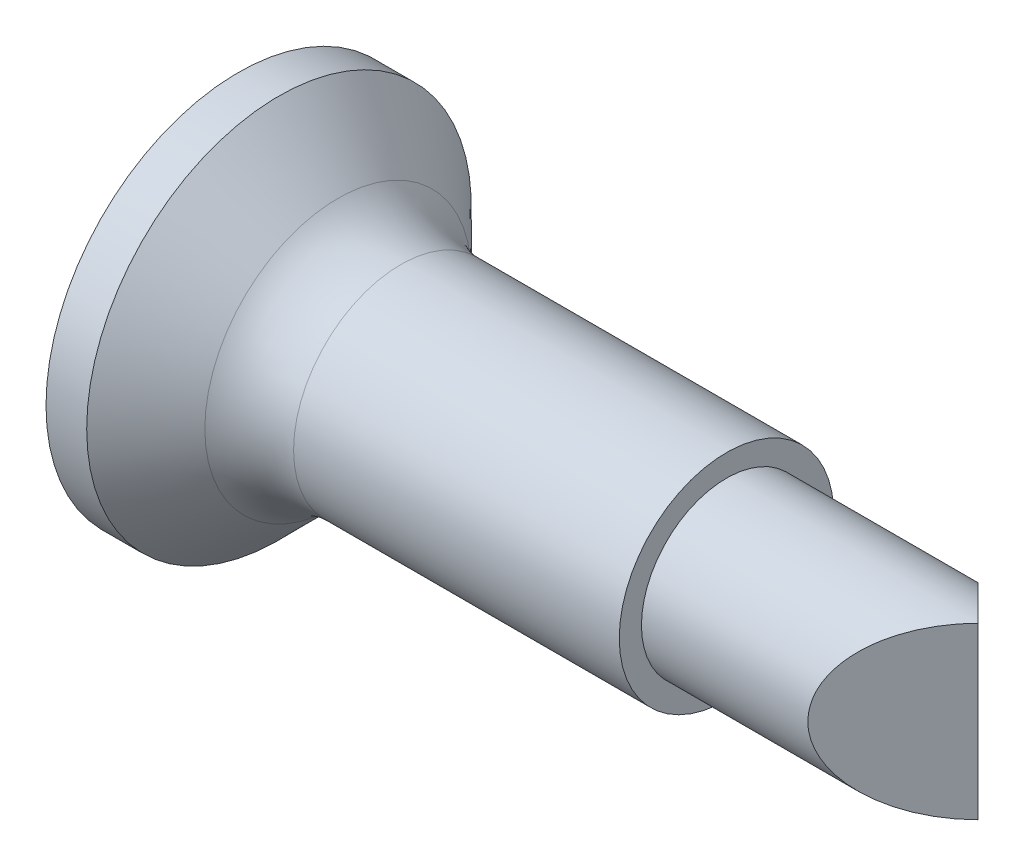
from build123d import *

# Parameters (mm, degrees)
FILLET1_R               = 1.2
CUT_EXTRUDE1_DEPTH      = 11.65457653
CUT_EXTRUDE1_DEPTH_BACK = 11.65457653
CROSSRECESS_DEPTH       = 0.566666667
FILLET2_R               = 0.32
DRAFT1_ANGLE            = 25


with BuildPart() as part:
    # Sketch1 → Base (revolve)
    with BuildSketch(Plane.XY, mode=Mode.PRIVATE) as base_sk:
        Polygon((0, 0), (0, 2.6), (0.55, 2.6), (1.7, 1.45), (6.6, 1.45), (6.6, 1.15), (10, 1.15), (10, 0), align=None)
    revolve(base_sk.sketch.rotate(Axis((-9.542985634, 0, 0), (1, 0, 0)), 90), axis=Axis((-9.542985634, 0, 0), (1, 0, 0)))

    # Fillet1
    fillet1_edges = [part.edges().sort_by_distance(p)[0] for p in [
        (1.7, 0, -1.45),
    ]]
    fillet(fillet1_edges, radius=FILLET1_R)

    # Sketch2 → Cut-Extrude1 (cut, two sides: drawn at the far end of the back side and taken through both)
    with BuildSketch(Plane(origin=(0, 0, 0), x_dir=(1, 0, 0), z_dir=(0, 1, 0)).offset(-CUT_EXTRUDE1_DEPTH_BACK)):
        Polygon((10.37032733, -10), (10.37032733, 10), (0, 10), (10, 0), (0, -10), align=None)
    extrude(amount=CUT_EXTRUDE1_DEPTH + CUT_EXTRUDE1_DEPTH_BACK, mode=Mode.SUBTRACT)

    # Sketch3 → CrossRecess (cut)
    with BuildSketch(Plane(origin=(0, 0, 0), x_dir=(0, 0, -1), z_dir=(1, 0, 0))):
        Polygon((-0.32, 0.32), (-1.6, 0.32), (-1.6, -0.32), (-0.32, -0.32), (-0.32, -1.6), (0.32, -1.6), (0.32, -0.32), (1.6, -0.32), (1.6, 0.32), (0.32, 0.32), (0.32, 1.6), (-0.32, 1.6), align=None)
    extrude(amount=CROSSRECESS_DEPTH, mode=Mode.SUBTRACT)

    # Fillet2
    fillet2_edges = [part.edges().sort_by_distance(p)[0] for p in [
        (0.283333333, -0.32, -0.32),
        (0.283333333, 0.32, -0.32),
        (0.283333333, 0.32, 0.32),
        (0.283333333, -0.32, 0.32),
    ]]
    fillet(fillet2_edges, radius=FILLET2_R)

    # Draft1
    draft1_faces = [part.faces().sort_by_distance(p)[0] for p in [
        (0.283333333, 0, 1.6),
        (0.283333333, 1.6, 0),
        (0.283333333, -1.6, 0),
        (0.283333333, 0, -1.6),
    ]]
    draft(draft1_faces, Plane(origin=(0, 0, 0), x_dir=(0, 0, -1), z_dir=(-1, 0, 0)), DRAFT1_ANGLE)


solid = part.part
